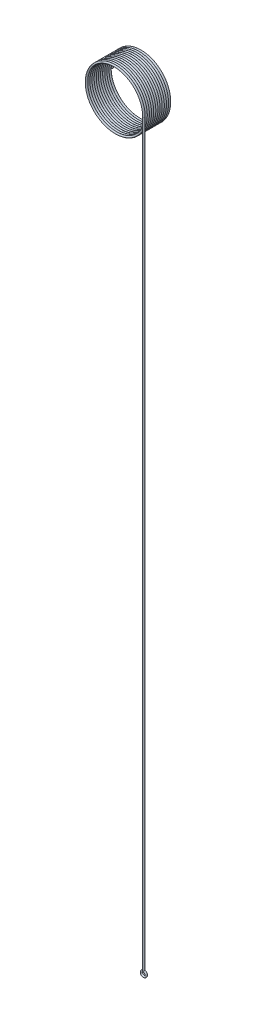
from build123d import *

# Parameters (mm, degrees)
SKETCH_3_R          = 0.6
SWEEP_2_PITCH       = 1.44
SWEEP_2_HEIGHT      = 18
SWEEP_2_RADIUS      = 19.75
SWEEP_2_START_ANGLE = 180
SKETCH_4_R          = 0.6
SKETCH_6_R          = 0.6


with BuildPart() as part:
    # Sweep 1: sweep along a path in Sketch 2
    with BuildLine(Plane.XY) as sweep_1_path:
        Line((19.75, 0), (19.75, -500))
    # Sketch 3 → Sweep 1 (sweep)
    with BuildSketch(Plane(origin=(0, -500, 0), x_dir=(-1, 0, 0), z_dir=(0, 1, 0))):
        with Locations((-19.75, 0)):
            Circle(SKETCH_3_R)
    sweep(path=sweep_1_path.line)

    # Sweep 2: sweep along a helix
    with BuildLine() as sweep_2_path:
        add(Helix(SWEEP_2_PITCH, SWEEP_2_HEIGHT, SWEEP_2_RADIUS, center=(0, 0, 0), direction=(0, 0, -1), lefthand=True, mode=Mode.PRIVATE).rotate(Axis((0, 0, 0), (0, 0, -1)), SWEEP_2_START_ANGLE))
    # Sketch 4 → Sweep 2 (sweep)
    with BuildSketch(Plane(origin=(0, 0, 0), x_dir=(1, 0, 0), z_dir=(0, 1, 0))):
        with Locations((19.75, 0)):
            Circle(SKETCH_4_R)
    sweep(path=sweep_2_path.line, is_frenet=True)

    # Sweep 3: sweep along a path in Sketch 5
    with BuildLine(Plane.XY) as sweep_3_path:
        CenterArc((19.75, -501.6), 1.6, 0, 360)
    # Sketch 6 → Sweep 3 (sweep)
    with BuildSketch(Plane(origin=(0, -501.6, 0), x_dir=(-1, 0, 0), z_dir=(0, 1, 0))):
        with Locations((-18.15, 0)):
            Circle(SKETCH_6_R)
    sweep(path=sweep_3_path.line)


solid = part.part
